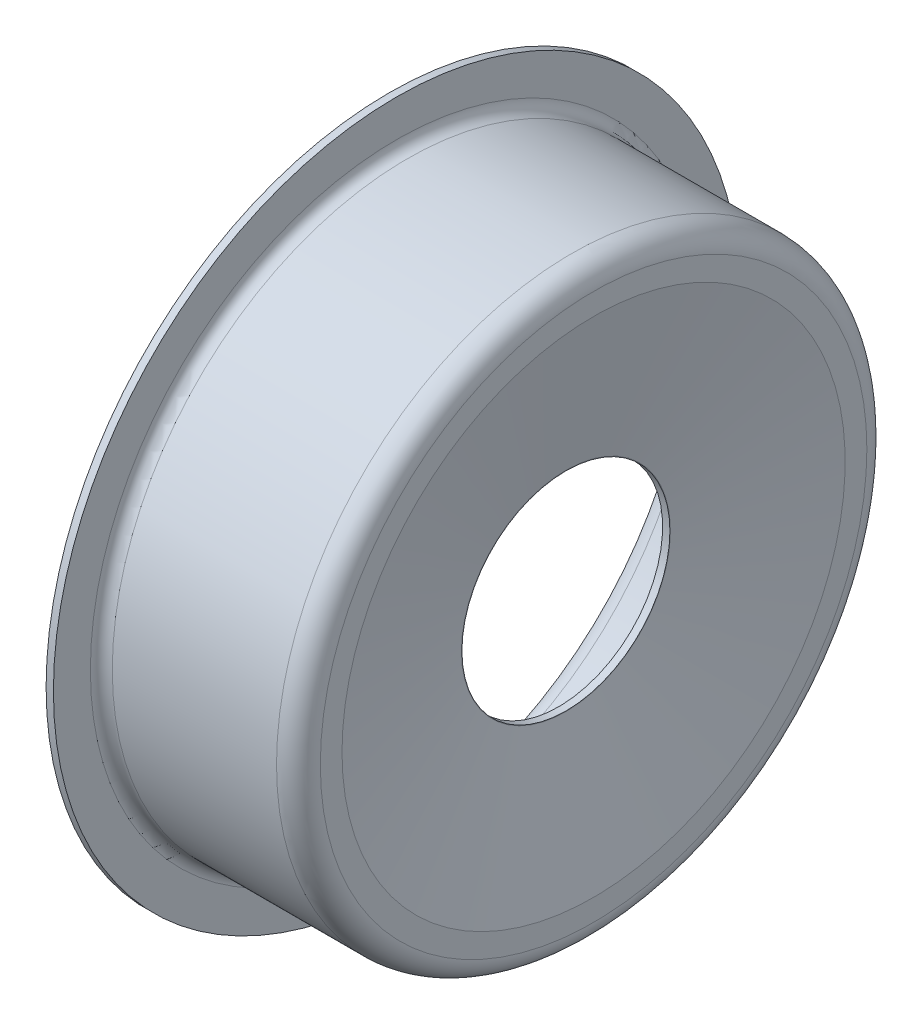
from build123d import *

# Parameters (mm, degrees)
SKETCH2_R          = 14.25
CUT_EXTRUDE1_DEPTH = 2.311002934


with BuildPart() as part:
    # Sketch1 → Revolve-Thin1 (revolve)
    with BuildSketch(Plane.XY, mode=Mode.PRIVATE) as revolve_thin1_sk:
        with BuildLine():
            Line((54.291040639, 47), (54.291040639, 41.93550908))
            ThreePointArc((54.291040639, 41.93550908), (54.730380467, 40.874848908), (55.791040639, 40.43550908))
            Line((55.791040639, 40.43550908), (78.291040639, 40.43550908))
            ThreePointArc((78.291040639, 40.43550908), (80.412360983, 39.556829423), (81.291040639, 37.43550908))
            Line((81.291040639, 37.43550908), (81.291040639, 34.465702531))
            Line((81.291040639, 34.465702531), (77.5, 14.317605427))
            Line((77.5, 14.317605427), (77.5, 0))
            Line((77.5, 0), (76.5, 0))
            Line((76.5, 0), (76.5, 14.410866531))
            Line((76.5, 14.410866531), (80.291040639, 34.558963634))
            Line((80.291040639, 34.558963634), (80.291040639, 37.43550908))
            ThreePointArc((80.291040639, 37.43550908), (79.705254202, 38.849722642), (78.291040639, 39.43550908))
            Line((78.291040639, 39.43550908), (55.791040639, 39.43550908))
            ThreePointArc((55.791040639, 39.43550908), (54.023273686, 40.167742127), (53.291040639, 41.93550908))
            Line((53.291040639, 41.93550908), (53.291040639, 47))
            Line((53.291040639, 47), (54.291040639, 47))
        make_face()
    revolve(revolve_thin1_sk.sketch.rotate(Axis((0, 0, 0), (1, 0, 0)), 90), axis=Axis((0, 0, 0), (1, 0, 0)))

    # Sketch2 → Cut-Extrude1 (cut)
    with BuildSketch(Plane.ZY.offset(-76.5)):
        Circle(SKETCH2_R)
    extrude(amount=-CUT_EXTRUDE1_DEPTH, mode=Mode.SUBTRACT)


solid = part.part
